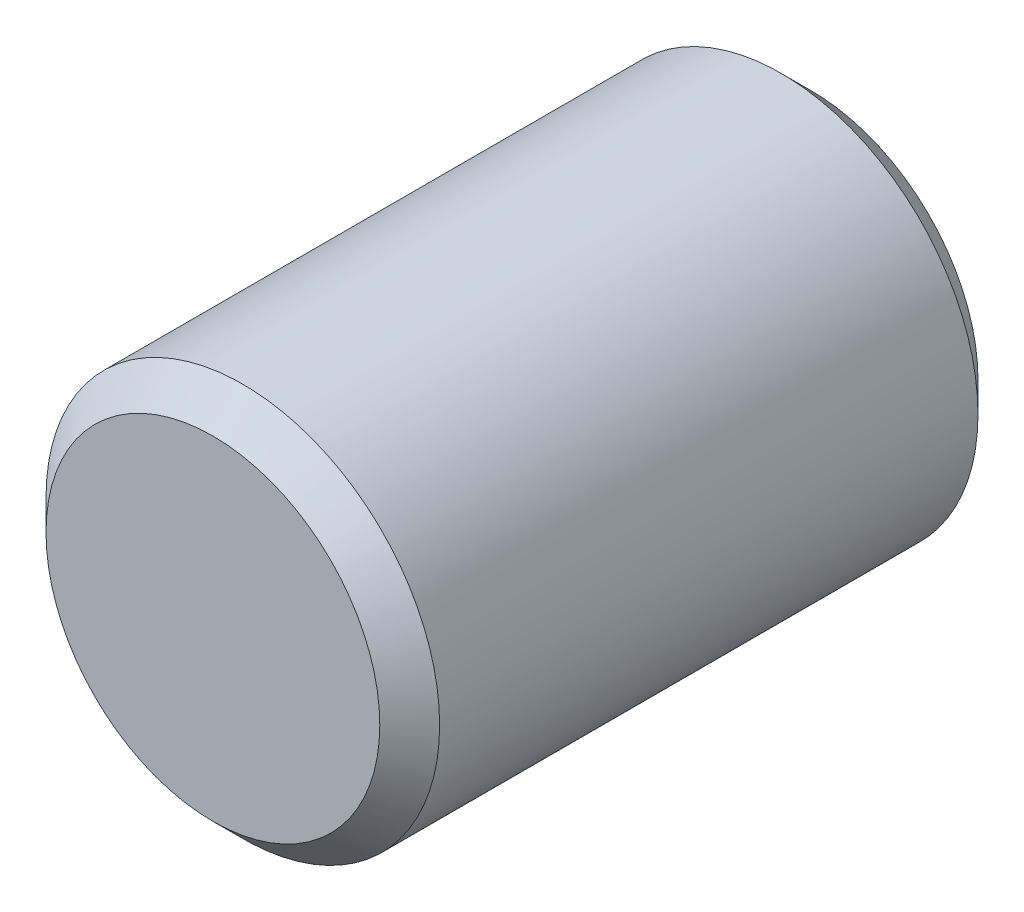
from build123d import *

# Parameters (mm, degrees)
ESQUISSE1_R      = 6.58
EXTRUSION1_DEPTH = 20
CHANFREIN1_SIZE  = 1


with BuildPart() as part:
    # Esquisse1 → Extrusion1 (new body)
    with BuildSketch(Plane.XY):
        with Locations(Location((0, 0, 0), (0, 0, 180))):
            Circle(ESQUISSE1_R)
    extrude(amount=EXTRUSION1_DEPTH)

    # Chanfrein1
    chanfrein1_edges = [part.edges().sort_by_distance(p)[0] for p in [
        (6.58, 0, 0),
        (6.58, 0, 20),
    ]]
    chamfer(chanfrein1_edges, length=CHANFREIN1_SIZE)


solid = part.part
